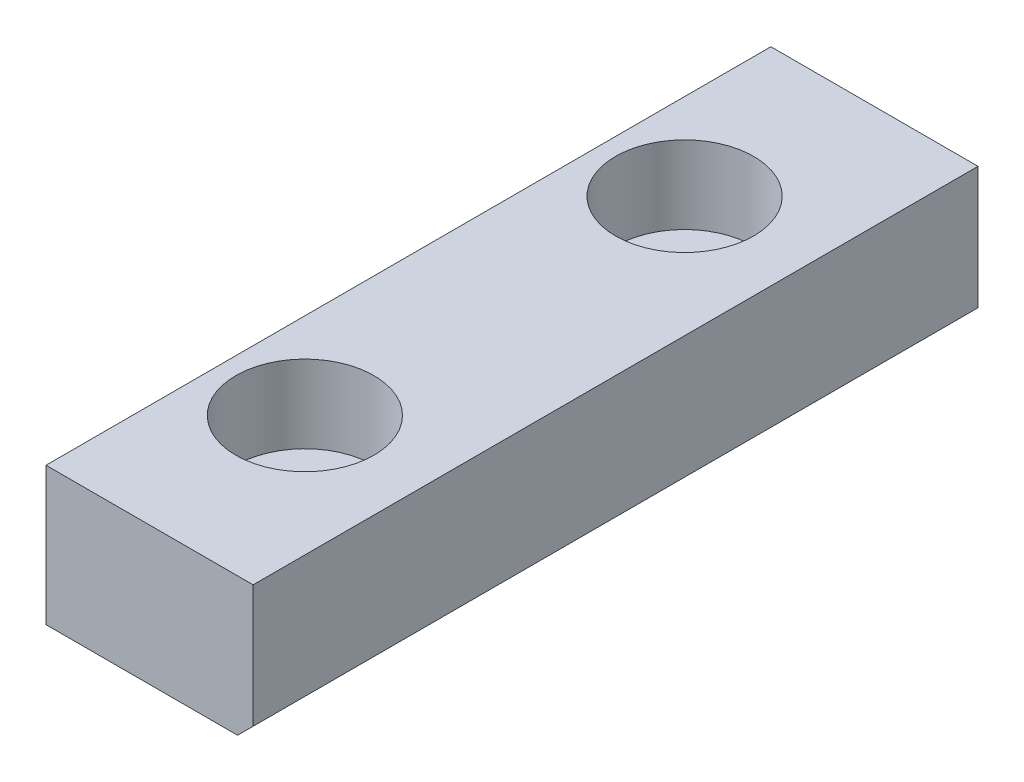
ISO-10303-21;
HEADER;
FILE_DESCRIPTION(('STEP AP214'),'2;1');
FILE_NAME('part.step','',(''),(''),'','','');
FILE_SCHEMA(('AUTOMOTIVE_DESIGN { 1 0 10303 214 1 1 1 1 }'));
ENDSEC;
DATA;
#1=APPLICATION_CONTEXT('core data for automotive mechanical design processes');
#2=APPLICATION_PROTOCOL_DEFINITION('international standard','automotive_design',2000,#1);
#3=PRODUCT_CONTEXT('',#1,'mechanical');
#4=PRODUCT('Part','Part','',(#3));
#5=PRODUCT_RELATED_PRODUCT_CATEGORY('part','',(#4));
#6=PRODUCT_DEFINITION_FORMATION('','',#4);
#7=PRODUCT_DEFINITION_CONTEXT('part definition',#1,'design');
#8=PRODUCT_DEFINITION('design','',#6,#7);
#9=PRODUCT_DEFINITION_SHAPE('','',#8);
#10=(LENGTH_UNIT() NAMED_UNIT(*) SI_UNIT(.MILLI.,.METRE.));
#11=(NAMED_UNIT(*) PLANE_ANGLE_UNIT() SI_UNIT($,.RADIAN.));
#12=(NAMED_UNIT(*) SI_UNIT($,.STERADIAN.) SOLID_ANGLE_UNIT());
#13=UNCERTAINTY_MEASURE_WITH_UNIT(LENGTH_MEASURE(1.E-05),#10,'distance_accuracy_value','');
#14=(GEOMETRIC_REPRESENTATION_CONTEXT(3) GLOBAL_UNCERTAINTY_ASSIGNED_CONTEXT((#13)) GLOBAL_UNIT_ASSIGNED_CONTEXT((#10,
#11,#12)) REPRESENTATION_CONTEXT('',''));
#15=CARTESIAN_POINT('',(0.,0.,0.));
#16=DIRECTION('',(0.,0.,1.));
#17=DIRECTION('',(1.,0.,0.));
#18=AXIS2_PLACEMENT_3D('',#15,#16,#17);
#19=CARTESIAN_POINT('',(5.,-34.,32.));
#20=DIRECTION('',(0.,1.,0.));
#21=DIRECTION('',(0.,0.,1.));
#22=AXIS2_PLACEMENT_3D('',#19,#20,#21);
#23=CYLINDRICAL_SURFACE('',#22,2.25);
#24=CARTESIAN_POINT('',(5.,0.,32.));
#25=DIRECTION('',(0.,1.,0.));
#26=DIRECTION('',(0.,0.,1.));
#27=AXIS2_PLACEMENT_3D('',#24,#25,#26);
#28=CIRCLE('',#27,2.25);
#29=CARTESIAN_POINT('',(5.,0.,34.25));
#30=VERTEX_POINT('',#29);
#31=EDGE_CURVE('E123',#30,#30,#28,.T.);
#32=CARTESIAN_POINT('',(5.,3.5,32.));
#33=DIRECTION('',(0.,1.,0.));
#34=DIRECTION('',(0.,0.,1.));
#35=AXIS2_PLACEMENT_3D('',#32,#33,#34);
#36=CIRCLE('',#35,2.25);
#37=CARTESIAN_POINT('',(5.,3.5,34.25));
#38=VERTEX_POINT('',#37);
#39=EDGE_CURVE('E36',#38,#38,#36,.F.);
#40=CARTESIAN_POINT('',(5.,0.,34.25));
#41=CARTESIAN_POINT('',(5.,0.0364583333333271,34.25));
#42=CARTESIAN_POINT('',(5.,0.072916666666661,34.25));
#43=CARTESIAN_POINT('',(5.,0.145833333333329,34.25));
#44=CARTESIAN_POINT('',(5.,0.182291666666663,34.25));
#45=CARTESIAN_POINT('',(5.,0.255208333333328,34.25));
#46=CARTESIAN_POINT('',(5.,0.29166666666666,34.25));
#47=CARTESIAN_POINT('',(5.,0.364583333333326,34.25));
#48=CARTESIAN_POINT('',(5.,0.40104166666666,34.25));
#49=CARTESIAN_POINT('',(5.,0.473958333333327,34.25));
#50=CARTESIAN_POINT('',(5.,0.510416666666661,34.25));
#51=CARTESIAN_POINT('',(5.,0.583333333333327,34.25));
#52=CARTESIAN_POINT('',(5.,0.619791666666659,34.25));
#53=CARTESIAN_POINT('',(5.,0.692708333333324,34.25));
#54=CARTESIAN_POINT('',(5.,0.729166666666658,34.25));
#55=CARTESIAN_POINT('',(5.,0.802083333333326,34.25));
#56=CARTESIAN_POINT('',(5.,0.83854166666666,34.25));
#57=CARTESIAN_POINT('',(5.,0.911458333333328,34.25));
#58=CARTESIAN_POINT('',(5.,0.947916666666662,34.25));
#59=CARTESIAN_POINT('',(5.,1.02083333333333,34.25));
#60=CARTESIAN_POINT('',(5.,1.05729166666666,34.25));
#61=CARTESIAN_POINT('',(5.,1.13020833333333,34.25));
#62=CARTESIAN_POINT('',(5.,1.16666666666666,34.25));
#63=CARTESIAN_POINT('',(5.,1.23958333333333,34.25));
#64=CARTESIAN_POINT('',(5.,1.27604166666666,34.25));
#65=CARTESIAN_POINT('',(5.,1.34895833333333,34.25));
#66=CARTESIAN_POINT('',(5.,1.38541666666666,34.25));
#67=CARTESIAN_POINT('',(5.,1.45833333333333,34.25));
#68=CARTESIAN_POINT('',(5.,1.49479166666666,34.25));
#69=CARTESIAN_POINT('',(5.,1.56770833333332,34.25));
#70=CARTESIAN_POINT('',(5.,1.60416666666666,34.25));
#71=CARTESIAN_POINT('',(5.,1.67708333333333,34.25));
#72=CARTESIAN_POINT('',(5.,1.71354166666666,34.25));
#73=CARTESIAN_POINT('',(5.,1.78645833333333,34.25));
#74=CARTESIAN_POINT('',(5.,1.82291666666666,34.25));
#75=CARTESIAN_POINT('',(5.,1.89583333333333,34.25));
#76=CARTESIAN_POINT('',(5.,1.93229166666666,34.25));
#77=CARTESIAN_POINT('',(5.,2.00520833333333,34.25));
#78=CARTESIAN_POINT('',(5.,2.04166666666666,34.25));
#79=CARTESIAN_POINT('',(5.,2.11458333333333,34.25));
#80=CARTESIAN_POINT('',(5.,2.15104166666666,34.25));
#81=CARTESIAN_POINT('',(5.,2.22395833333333,34.25));
#82=CARTESIAN_POINT('',(5.,2.26041666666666,34.25));
#83=CARTESIAN_POINT('',(5.,2.33333333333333,34.25));
#84=CARTESIAN_POINT('',(5.,2.36979166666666,34.25));
#85=CARTESIAN_POINT('',(5.,2.44270833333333,34.25));
#86=CARTESIAN_POINT('',(5.,2.47916666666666,34.25));
#87=CARTESIAN_POINT('',(5.,2.55208333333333,34.25));
#88=CARTESIAN_POINT('',(5.,2.58854166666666,34.25));
#89=CARTESIAN_POINT('',(5.,2.66145833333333,34.25));
#90=CARTESIAN_POINT('',(5.,2.69791666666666,34.25));
#91=CARTESIAN_POINT('',(5.,2.77083333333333,34.25));
#92=CARTESIAN_POINT('',(5.,2.80729166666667,34.25));
#93=CARTESIAN_POINT('',(5.,2.88020833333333,34.25));
#94=CARTESIAN_POINT('',(5.,2.91666666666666,34.25));
#95=CARTESIAN_POINT('',(5.,2.98958333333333,34.25));
#96=CARTESIAN_POINT('',(5.,3.02604166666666,34.25));
#97=CARTESIAN_POINT('',(5.,3.09895833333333,34.25));
#98=CARTESIAN_POINT('',(5.,3.13541666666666,34.25));
#99=CARTESIAN_POINT('',(5.,3.20833333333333,34.25));
#100=CARTESIAN_POINT('',(5.,3.24479166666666,34.25));
#101=CARTESIAN_POINT('',(5.,3.31770833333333,34.25));
#102=CARTESIAN_POINT('',(5.,3.35416666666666,34.25));
#103=CARTESIAN_POINT('',(5.,3.42708333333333,34.25));
#104=CARTESIAN_POINT('',(5.,3.46354166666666,34.25));
#105=CARTESIAN_POINT('',(5.,3.5,34.25));
#106=B_SPLINE_CURVE_WITH_KNOTS('',3,(#40,#41,#42,#43,#44,#45,#46,#47,#48,#49,#50,#51,#52,#53,
#54,#55,#56,#57,#58,#59,#60,#61,#62,#63,#64,#65,#66,#67,#68,#69,#70,#71,#72,#73,#74,#75,#76,#77,
#78,#79,#80,#81,#82,#83,#84,#85,#86,#87,#88,#89,#90,#91,#92,#93,#94,#95,#96,#97,#98,#99,#100,
#101,#102,#103,#104,#105),.UNSPECIFIED.,.F.,.F.,(4,2,2,2,2,2,2,2,2,2,2,2,2,2,2,2,2,2,2,2,2,2,2,
2,2,2,2,2,2,2,2,2,4),(0.,0.109375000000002,0.218750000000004,0.328124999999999,0.4375,
0.546875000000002,0.656249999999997,0.765624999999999,0.875000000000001,0.984375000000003,
1.09375,1.203125,1.3125,1.421875,1.53125,1.640625,1.75,1.859375,1.96875000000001,2.078125,
2.1875,2.296875,2.40625,2.515625,2.625,2.734375,2.84375000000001,2.953125,3.0625,3.171875,
3.28125,3.390625,3.5),.UNSPECIFIED.);
#107=EDGE_CURVE('BSEAM32',#30,#38,#106,.T.);
#108=ORIENTED_EDGE('',*,*,#31,.F.);
#109=ORIENTED_EDGE('',*,*,#39,.F.);
#110=ORIENTED_EDGE('',*,*,#107,.T.);
#111=ORIENTED_EDGE('',*,*,#107,.F.);
#112=EDGE_LOOP('',(#108,#110,#109,#111));
#113=FACE_BOUND('',#112,.T.);
#114=ADVANCED_FACE('F32',(#113),#23,.F.);
#115=CARTESIAN_POINT('',(5.,-34.,10.));
#116=DIRECTION('',(0.,1.,0.));
#117=DIRECTION('',(0.,0.,1.));
#118=AXIS2_PLACEMENT_3D('',#115,#116,#117);
#119=CYLINDRICAL_SURFACE('',#118,2.25);
#120=CARTESIAN_POINT('',(5.,0.,10.));
#121=DIRECTION('',(0.,1.,0.));
#122=DIRECTION('',(0.,0.,1.));
#123=AXIS2_PLACEMENT_3D('',#120,#121,#122);
#124=CIRCLE('',#123,2.25);
#125=CARTESIAN_POINT('',(5.,0.,12.25));
#126=VERTEX_POINT('',#125);
#127=EDGE_CURVE('E113',#126,#126,#124,.T.);
#128=CARTESIAN_POINT('',(5.,3.5,10.));
#129=DIRECTION('',(0.,1.,0.));
#130=DIRECTION('',(0.,0.,1.));
#131=AXIS2_PLACEMENT_3D('',#128,#129,#130);
#132=CIRCLE('',#131,2.25);
#133=CARTESIAN_POINT('',(5.,3.5,12.25));
#134=VERTEX_POINT('',#133);
#135=EDGE_CURVE('E121',#134,#134,#132,.F.);
#136=CARTESIAN_POINT('',(5.,0.,12.25));
#137=CARTESIAN_POINT('',(5.,0.0364583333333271,12.25));
#138=CARTESIAN_POINT('',(5.,0.072916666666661,12.25));
#139=CARTESIAN_POINT('',(5.,0.145833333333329,12.25));
#140=CARTESIAN_POINT('',(5.,0.182291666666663,12.25));
#141=CARTESIAN_POINT('',(5.,0.255208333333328,12.25));
#142=CARTESIAN_POINT('',(5.,0.29166666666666,12.25));
#143=CARTESIAN_POINT('',(5.,0.364583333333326,12.25));
#144=CARTESIAN_POINT('',(5.,0.40104166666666,12.25));
#145=CARTESIAN_POINT('',(5.,0.473958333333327,12.25));
#146=CARTESIAN_POINT('',(5.,0.510416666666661,12.25));
#147=CARTESIAN_POINT('',(5.,0.583333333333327,12.25));
#148=CARTESIAN_POINT('',(5.,0.619791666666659,12.25));
#149=CARTESIAN_POINT('',(5.,0.692708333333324,12.25));
#150=CARTESIAN_POINT('',(5.,0.729166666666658,12.25));
#151=CARTESIAN_POINT('',(5.,0.802083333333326,12.25));
#152=CARTESIAN_POINT('',(5.,0.83854166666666,12.25));
#153=CARTESIAN_POINT('',(5.,0.911458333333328,12.25));
#154=CARTESIAN_POINT('',(5.,0.947916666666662,12.25));
#155=CARTESIAN_POINT('',(5.,1.02083333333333,12.25));
#156=CARTESIAN_POINT('',(5.,1.05729166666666,12.25));
#157=CARTESIAN_POINT('',(5.,1.13020833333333,12.25));
#158=CARTESIAN_POINT('',(5.,1.16666666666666,12.25));
#159=CARTESIAN_POINT('',(5.,1.23958333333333,12.25));
#160=CARTESIAN_POINT('',(5.,1.27604166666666,12.25));
#161=CARTESIAN_POINT('',(5.,1.34895833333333,12.25));
#162=CARTESIAN_POINT('',(5.,1.38541666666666,12.25));
#163=CARTESIAN_POINT('',(5.,1.45833333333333,12.25));
#164=CARTESIAN_POINT('',(5.,1.49479166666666,12.25));
#165=CARTESIAN_POINT('',(5.,1.56770833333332,12.25));
#166=CARTESIAN_POINT('',(5.,1.60416666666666,12.25));
#167=CARTESIAN_POINT('',(5.,1.67708333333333,12.25));
#168=CARTESIAN_POINT('',(5.,1.71354166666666,12.25));
#169=CARTESIAN_POINT('',(5.,1.78645833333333,12.25));
#170=CARTESIAN_POINT('',(5.,1.82291666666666,12.25));
#171=CARTESIAN_POINT('',(5.,1.89583333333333,12.25));
#172=CARTESIAN_POINT('',(5.,1.93229166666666,12.25));
#173=CARTESIAN_POINT('',(5.,2.00520833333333,12.25));
#174=CARTESIAN_POINT('',(5.,2.04166666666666,12.25));
#175=CARTESIAN_POINT('',(5.,2.11458333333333,12.25));
#176=CARTESIAN_POINT('',(5.,2.15104166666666,12.25));
#177=CARTESIAN_POINT('',(5.,2.22395833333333,12.25));
#178=CARTESIAN_POINT('',(5.,2.26041666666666,12.25));
#179=CARTESIAN_POINT('',(5.,2.33333333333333,12.25));
#180=CARTESIAN_POINT('',(5.,2.36979166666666,12.25));
#181=CARTESIAN_POINT('',(5.,2.44270833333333,12.25));
#182=CARTESIAN_POINT('',(5.,2.47916666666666,12.25));
#183=CARTESIAN_POINT('',(5.,2.55208333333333,12.25));
#184=CARTESIAN_POINT('',(5.,2.58854166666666,12.25));
#185=CARTESIAN_POINT('',(5.,2.66145833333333,12.25));
#186=CARTESIAN_POINT('',(5.,2.69791666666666,12.25));
#187=CARTESIAN_POINT('',(5.,2.77083333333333,12.25));
#188=CARTESIAN_POINT('',(5.,2.80729166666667,12.25));
#189=CARTESIAN_POINT('',(5.,2.88020833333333,12.25));
#190=CARTESIAN_POINT('',(5.,2.91666666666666,12.25));
#191=CARTESIAN_POINT('',(5.,2.98958333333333,12.25));
#192=CARTESIAN_POINT('',(5.,3.02604166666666,12.25));
#193=CARTESIAN_POINT('',(5.,3.09895833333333,12.25));
#194=CARTESIAN_POINT('',(5.,3.13541666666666,12.25));
#195=CARTESIAN_POINT('',(5.,3.20833333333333,12.25));
#196=CARTESIAN_POINT('',(5.,3.24479166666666,12.25));
#197=CARTESIAN_POINT('',(5.,3.31770833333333,12.25));
#198=CARTESIAN_POINT('',(5.,3.35416666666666,12.25));
#199=CARTESIAN_POINT('',(5.,3.42708333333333,12.25));
#200=CARTESIAN_POINT('',(5.,3.46354166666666,12.25));
#201=CARTESIAN_POINT('',(5.,3.5,12.25));
#202=B_SPLINE_CURVE_WITH_KNOTS('',3,(#136,#137,#138,#139,#140,#141,#142,#143,#144,#145,#146,
#147,#148,#149,#150,#151,#152,#153,#154,#155,#156,#157,#158,#159,#160,#161,#162,#163,#164,#165,
#166,#167,#168,#169,#170,#171,#172,#173,#174,#175,#176,#177,#178,#179,#180,#181,#182,#183,#184,
#185,#186,#187,#188,#189,#190,#191,#192,#193,#194,#195,#196,#197,#198,#199,#200,#201),
.UNSPECIFIED.,.F.,.F.,(4,2,2,2,2,2,2,2,2,2,2,2,2,2,2,2,2,2,2,2,2,2,2,2,2,2,2,2,2,2,2,2,4),(0.,
0.109375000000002,0.218750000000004,0.328124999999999,0.4375,0.546875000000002,
0.656249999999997,0.765624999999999,0.875000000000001,0.984375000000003,1.09375,1.203125,1.3125,
1.421875,1.53125,1.640625,1.75,1.859375,1.96875000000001,2.078125,2.1875,2.296875,2.40625,
2.515625,2.625,2.734375,2.84375000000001,2.953125,3.0625,3.171875,3.28125,3.390625,3.5),.UNSPECIFIED.);
#203=EDGE_CURVE('BSEAM162',#126,#134,#202,.T.);
#204=ORIENTED_EDGE('',*,*,#127,.F.);
#205=ORIENTED_EDGE('',*,*,#135,.F.);
#206=ORIENTED_EDGE('',*,*,#203,.T.);
#207=ORIENTED_EDGE('',*,*,#203,.F.);
#208=EDGE_LOOP('',(#204,#206,#205,#207));
#209=FACE_BOUND('',#208,.T.);
#210=ADVANCED_FACE('F162',(#209),#119,.F.);
#211=CARTESIAN_POINT('',(0.,0.,42.));
#212=DIRECTION('',(1.,0.,0.));
#213=DIRECTION('',(0.,0.,-1.));
#214=AXIS2_PLACEMENT_3D('',#211,#212,#213);
#215=PLANE('',#214);
#216=DIRECTION('',(0.,-1.,0.));
#217=VECTOR('',#216,1.);
#218=CARTESIAN_POINT('',(0.,0.,0.));
#219=LINE('',#218,#217);
#220=CARTESIAN_POINT('',(0.,8.,0.));
#221=VERTEX_POINT('',#220);
#222=CARTESIAN_POINT('',(0.,0.,0.));
#223=VERTEX_POINT('',#222);
#224=EDGE_CURVE('E109',#221,#223,#219,.T.);
#225=ORIENTED_EDGE('',*,*,#224,.T.);
#226=DIRECTION('',(0.,0.,-1.));
#227=VECTOR('',#226,1.);
#228=CARTESIAN_POINT('',(0.,0.,42.));
#229=LINE('',#228,#227);
#230=CARTESIAN_POINT('',(0.,0.,42.));
#231=VERTEX_POINT('',#230);
#232=EDGE_CURVE('E11',#231,#223,#229,.T.);
#233=ORIENTED_EDGE('',*,*,#232,.F.);
#234=DIRECTION('',(0.,-1.,0.));
#235=VECTOR('',#234,1.);
#236=CARTESIAN_POINT('',(0.,0.,42.));
#237=LINE('',#236,#235);
#238=CARTESIAN_POINT('',(0.,8.,42.));
#239=VERTEX_POINT('',#238);
#240=EDGE_CURVE('E118',#239,#231,#237,.T.);
#241=ORIENTED_EDGE('',*,*,#240,.F.);
#242=DIRECTION('',(0.,0.,-1.));
#243=VECTOR('',#242,1.);
#244=CARTESIAN_POINT('',(0.,8.,42.));
#245=LINE('',#244,#243);
#246=EDGE_CURVE('E105',#239,#221,#245,.T.);
#247=ORIENTED_EDGE('',*,*,#246,.T.);
#248=EDGE_LOOP('',(#225,#233,#241,#247));
#249=FACE_BOUND('',#248,.T.);
#250=ADVANCED_FACE('F34',(#249),#215,.F.);
#251=CARTESIAN_POINT('',(0.,0.,42.));
#252=DIRECTION('',(0.,1.,0.));
#253=DIRECTION('',(0.,0.,1.));
#254=AXIS2_PLACEMENT_3D('',#251,#252,#253);
#255=PLANE('',#254);
#256=ORIENTED_EDGE('',*,*,#31,.T.);
#257=EDGE_LOOP('',(#256));
#258=FACE_BOUND('',#257,.T.);
#259=ORIENTED_EDGE('',*,*,#127,.T.);
#260=EDGE_LOOP('',(#259));
#261=FACE_BOUND('',#260,.T.);
#262=DIRECTION('',(1.,0.,0.));
#263=VECTOR('',#262,1.);
#264=CARTESIAN_POINT('',(0.,0.,0.));
#265=LINE('',#264,#263);
#266=CARTESIAN_POINT('',(11.1000000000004,0.,0.));
#267=VERTEX_POINT('',#266);
#268=EDGE_CURVE('E112',#223,#267,#265,.T.);
#269=ORIENTED_EDGE('',*,*,#268,.T.);
#270=DIRECTION('',(0.,0.,-1.));
#271=VECTOR('',#270,1.);
#272=CARTESIAN_POINT('',(11.1000000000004,0.,42.));
#273=LINE('',#272,#271);
#274=CARTESIAN_POINT('',(11.1000000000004,0.,42.));
#275=VERTEX_POINT('',#274);
#276=EDGE_CURVE('E42',#275,#267,#273,.T.);
#277=ORIENTED_EDGE('',*,*,#276,.F.);
#278=DIRECTION('',(1.,0.,0.));
#279=VECTOR('',#278,1.);
#280=CARTESIAN_POINT('',(0.,0.,42.));
#281=LINE('',#280,#279);
#282=EDGE_CURVE('E85',#231,#275,#281,.T.);
#283=ORIENTED_EDGE('',*,*,#282,.F.);
#284=ORIENTED_EDGE('',*,*,#232,.T.);
#285=EDGE_LOOP('',(#269,#277,#283,#284));
#286=FACE_BOUND('',#285,.T.);
#287=ADVANCED_FACE('F146',(#258,#261,#286),#255,.F.);
#288=CARTESIAN_POINT('',(12.,0.900000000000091,42.));
#289=DIRECTION('',(-0.707106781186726,0.707106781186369,0.));
#290=DIRECTION('',(-0.707106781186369,-0.707106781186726,0.));
#291=AXIS2_PLACEMENT_3D('',#288,#289,#290);
#292=PLANE('',#291);
#293=DIRECTION('',(0.707106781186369,0.707106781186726,0.));
#294=VECTOR('',#293,1.);
#295=CARTESIAN_POINT('',(12.,0.900000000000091,0.));
#296=LINE('',#295,#294);
#297=CARTESIAN_POINT('',(12.,0.900000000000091,0.));
#298=VERTEX_POINT('',#297);
#299=EDGE_CURVE('E100',#267,#298,#296,.T.);
#300=ORIENTED_EDGE('',*,*,#299,.T.);
#301=DIRECTION('',(0.,0.,-1.));
#302=VECTOR('',#301,1.);
#303=CARTESIAN_POINT('',(12.,0.900000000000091,42.));
#304=LINE('',#303,#302);
#305=CARTESIAN_POINT('',(12.,0.900000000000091,42.));
#306=VERTEX_POINT('',#305);
#307=EDGE_CURVE('E97',#306,#298,#304,.T.);
#308=ORIENTED_EDGE('',*,*,#307,.F.);
#309=DIRECTION('',(0.707106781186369,0.707106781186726,0.));
#310=VECTOR('',#309,1.);
#311=CARTESIAN_POINT('',(12.,0.900000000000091,42.));
#312=LINE('',#311,#310);
#313=EDGE_CURVE('E89',#275,#306,#312,.T.);
#314=ORIENTED_EDGE('',*,*,#313,.F.);
#315=ORIENTED_EDGE('',*,*,#276,.T.);
#316=EDGE_LOOP('',(#300,#308,#314,#315));
#317=FACE_BOUND('',#316,.T.);
#318=ADVANCED_FACE('F98',(#317),#292,.F.);
#319=CARTESIAN_POINT('',(12.,0.900000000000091,42.));
#320=DIRECTION('',(-1.,0.,0.));
#321=DIRECTION('',(0.,0.,1.));
#322=AXIS2_PLACEMENT_3D('',#319,#320,#321);
#323=PLANE('',#322);
#324=DIRECTION('',(0.,1.,0.));
#325=VECTOR('',#324,1.);
#326=CARTESIAN_POINT('',(12.,0.900000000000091,0.));
#327=LINE('',#326,#325);
#328=CARTESIAN_POINT('',(12.,8.,0.));
#329=VERTEX_POINT('',#328);
#330=EDGE_CURVE('E71',#298,#329,#327,.T.);
#331=ORIENTED_EDGE('',*,*,#330,.T.);
#332=DIRECTION('',(0.,0.,-1.));
#333=VECTOR('',#332,1.);
#334=CARTESIAN_POINT('',(12.,8.,42.));
#335=LINE('',#334,#333);
#336=CARTESIAN_POINT('',(12.,8.,42.));
#337=VERTEX_POINT('',#336);
#338=EDGE_CURVE('E101',#337,#329,#335,.T.);
#339=ORIENTED_EDGE('',*,*,#338,.F.);
#340=DIRECTION('',(0.,1.,0.));
#341=VECTOR('',#340,1.);
#342=CARTESIAN_POINT('',(12.,0.900000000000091,42.));
#343=LINE('',#342,#341);
#344=EDGE_CURVE('E93',#306,#337,#343,.T.);
#345=ORIENTED_EDGE('',*,*,#344,.F.);
#346=ORIENTED_EDGE('',*,*,#307,.T.);
#347=EDGE_LOOP('',(#331,#339,#345,#346));
#348=FACE_BOUND('',#347,.T.);
#349=ADVANCED_FACE('F103',(#348),#323,.F.);
#350=CARTESIAN_POINT('',(0.,8.,42.));
#351=DIRECTION('',(0.,-1.,0.));
#352=DIRECTION('',(0.,0.,-1.));
#353=AXIS2_PLACEMENT_3D('',#350,#351,#352);
#354=PLANE('',#353);
#355=CARTESIAN_POINT('',(5.,8.,32.));
#356=DIRECTION('',(0.,1.,0.));
#357=DIRECTION('',(0.,0.,1.));
#358=AXIS2_PLACEMENT_3D('',#355,#356,#357);
#359=CIRCLE('',#358,4.);
#360=CARTESIAN_POINT('',(5.,8.,36.));
#361=VERTEX_POINT('',#360);
#362=EDGE_CURVE('E137',#361,#361,#359,.T.);
#363=ORIENTED_EDGE('',*,*,#362,.F.);
#364=EDGE_LOOP('',(#363));
#365=FACE_BOUND('',#364,.T.);
#366=CARTESIAN_POINT('',(5.,8.,10.));
#367=DIRECTION('',(0.,1.,0.));
#368=DIRECTION('',(0.,0.,1.));
#369=AXIS2_PLACEMENT_3D('',#366,#367,#368);
#370=CIRCLE('',#369,4.);
#371=CARTESIAN_POINT('',(5.,8.,14.));
#372=VERTEX_POINT('',#371);
#373=EDGE_CURVE('E130',#372,#372,#370,.T.);
#374=ORIENTED_EDGE('',*,*,#373,.F.);
#375=EDGE_LOOP('',(#374));
#376=FACE_BOUND('',#375,.T.);
#377=DIRECTION('',(-1.,0.,0.));
#378=VECTOR('',#377,1.);
#379=CARTESIAN_POINT('',(0.,8.,0.));
#380=LINE('',#379,#378);
#381=EDGE_CURVE('E77',#329,#221,#380,.T.);
#382=ORIENTED_EDGE('',*,*,#381,.T.);
#383=ORIENTED_EDGE('',*,*,#246,.F.);
#384=DIRECTION('',(-1.,0.,0.));
#385=VECTOR('',#384,1.);
#386=CARTESIAN_POINT('',(0.,8.,42.));
#387=LINE('',#386,#385);
#388=EDGE_CURVE('E51',#337,#239,#387,.T.);
#389=ORIENTED_EDGE('',*,*,#388,.F.);
#390=ORIENTED_EDGE('',*,*,#338,.T.);
#391=EDGE_LOOP('',(#382,#383,#389,#390));
#392=FACE_BOUND('',#391,.T.);
#393=ADVANCED_FACE('F158',(#365,#376,#392),#354,.F.);
#394=CARTESIAN_POINT('',(0.,8.,42.));
#395=DIRECTION('',(0.,0.,-1.));
#396=DIRECTION('',(-1.,0.,0.));
#397=AXIS2_PLACEMENT_3D('',#394,#395,#396);
#398=PLANE('',#397);
#399=ORIENTED_EDGE('',*,*,#240,.T.);
#400=ORIENTED_EDGE('',*,*,#282,.T.);
#401=ORIENTED_EDGE('',*,*,#313,.T.);
#402=ORIENTED_EDGE('',*,*,#344,.T.);
#403=ORIENTED_EDGE('',*,*,#388,.T.);
#404=EDGE_LOOP('',(#399,#400,#401,#402,#403));
#405=FACE_BOUND('',#404,.T.);
#406=ADVANCED_FACE('F91',(#405),#398,.F.);
#407=CARTESIAN_POINT('',(0.,8.,0.));
#408=DIRECTION('',(0.,0.,-1.));
#409=DIRECTION('',(-1.,0.,0.));
#410=AXIS2_PLACEMENT_3D('',#407,#408,#409);
#411=PLANE('',#410);
#412=ORIENTED_EDGE('',*,*,#224,.F.);
#413=ORIENTED_EDGE('',*,*,#381,.F.);
#414=ORIENTED_EDGE('',*,*,#330,.F.);
#415=ORIENTED_EDGE('',*,*,#299,.F.);
#416=ORIENTED_EDGE('',*,*,#268,.F.);
#417=EDGE_LOOP('',(#412,#413,#414,#415,#416));
#418=FACE_BOUND('',#417,.T.);
#419=ADVANCED_FACE('F148',(#418),#411,.T.);
#420=CARTESIAN_POINT('',(5.,3.5,10.));
#421=DIRECTION('',(0.,1.,0.));
#422=DIRECTION('',(0.,0.,1.));
#423=AXIS2_PLACEMENT_3D('',#420,#421,#422);
#424=PLANE('',#423);
#425=CARTESIAN_POINT('',(5.,3.5,10.));
#426=DIRECTION('',(0.,1.,0.));
#427=DIRECTION('',(0.,0.,1.));
#428=AXIS2_PLACEMENT_3D('',#425,#426,#427);
#429=CIRCLE('',#428,4.);
#430=CARTESIAN_POINT('',(5.,3.5,14.));
#431=VERTEX_POINT('',#430);
#432=EDGE_CURVE('E124',#431,#431,#429,.T.);
#433=ORIENTED_EDGE('',*,*,#432,.T.);
#434=EDGE_LOOP('',(#433));
#435=FACE_BOUND('',#434,.T.);
#436=ORIENTED_EDGE('',*,*,#135,.T.);
#437=EDGE_LOOP('',(#436));
#438=FACE_BOUND('',#437,.T.);
#439=ADVANCED_FACE('F150',(#435,#438),#424,.T.);
#440=CARTESIAN_POINT('',(5.,3.5,10.));
#441=DIRECTION('',(0.,1.,0.));
#442=DIRECTION('',(0.,0.,1.));
#443=AXIS2_PLACEMENT_3D('',#440,#441,#442);
#444=CYLINDRICAL_SURFACE('',#443,4.);
#445=ORIENTED_EDGE('',*,*,#432,.F.);
#446=EDGE_LOOP('',(#445));
#447=FACE_BOUND('',#446,.T.);
#448=ORIENTED_EDGE('',*,*,#373,.T.);
#449=EDGE_LOOP('',(#448));
#450=FACE_BOUND('',#449,.T.);
#451=ADVANCED_FACE('F156',(#447,#450),#444,.F.);
#452=CARTESIAN_POINT('',(5.,3.5,32.));
#453=DIRECTION('',(0.,1.,0.));
#454=DIRECTION('',(0.,0.,1.));
#455=AXIS2_PLACEMENT_3D('',#452,#453,#454);
#456=PLANE('',#455);
#457=CARTESIAN_POINT('',(5.,3.5,32.));
#458=DIRECTION('',(0.,1.,0.));
#459=DIRECTION('',(0.,0.,1.));
#460=AXIS2_PLACEMENT_3D('',#457,#458,#459);
#461=CIRCLE('',#460,4.);
#462=CARTESIAN_POINT('',(5.,3.5,36.));
#463=VERTEX_POINT('',#462);
#464=EDGE_CURVE('E188',#463,#463,#461,.T.);
#465=ORIENTED_EDGE('',*,*,#464,.T.);
#466=EDGE_LOOP('',(#465));
#467=FACE_BOUND('',#466,.T.);
#468=ORIENTED_EDGE('',*,*,#39,.T.);
#469=EDGE_LOOP('',(#468));
#470=FACE_BOUND('',#469,.T.);
#471=ADVANCED_FACE('F174',(#467,#470),#456,.T.);
#472=CARTESIAN_POINT('',(5.,3.5,32.));
#473=DIRECTION('',(0.,1.,0.));
#474=DIRECTION('',(0.,0.,1.));
#475=AXIS2_PLACEMENT_3D('',#472,#473,#474);
#476=CYLINDRICAL_SURFACE('',#475,4.);
#477=ORIENTED_EDGE('',*,*,#464,.F.);
#478=EDGE_LOOP('',(#477));
#479=FACE_BOUND('',#478,.T.);
#480=ORIENTED_EDGE('',*,*,#362,.T.);
#481=EDGE_LOOP('',(#480));
#482=FACE_BOUND('',#481,.T.);
#483=ADVANCED_FACE('F177',(#479,#482),#476,.F.);
#484=CLOSED_SHELL('',(#114,#210,#250,#287,#318,#349,#393,#406,#419,#439,#451,#471,#483));
#485=MANIFOLD_SOLID_BREP('B2',#484);
#486=ADVANCED_BREP_SHAPE_REPRESENTATION('',(#18,#485),#14);
#487=SHAPE_DEFINITION_REPRESENTATION(#9,#486);
ENDSEC;
END-ISO-10303-21;
